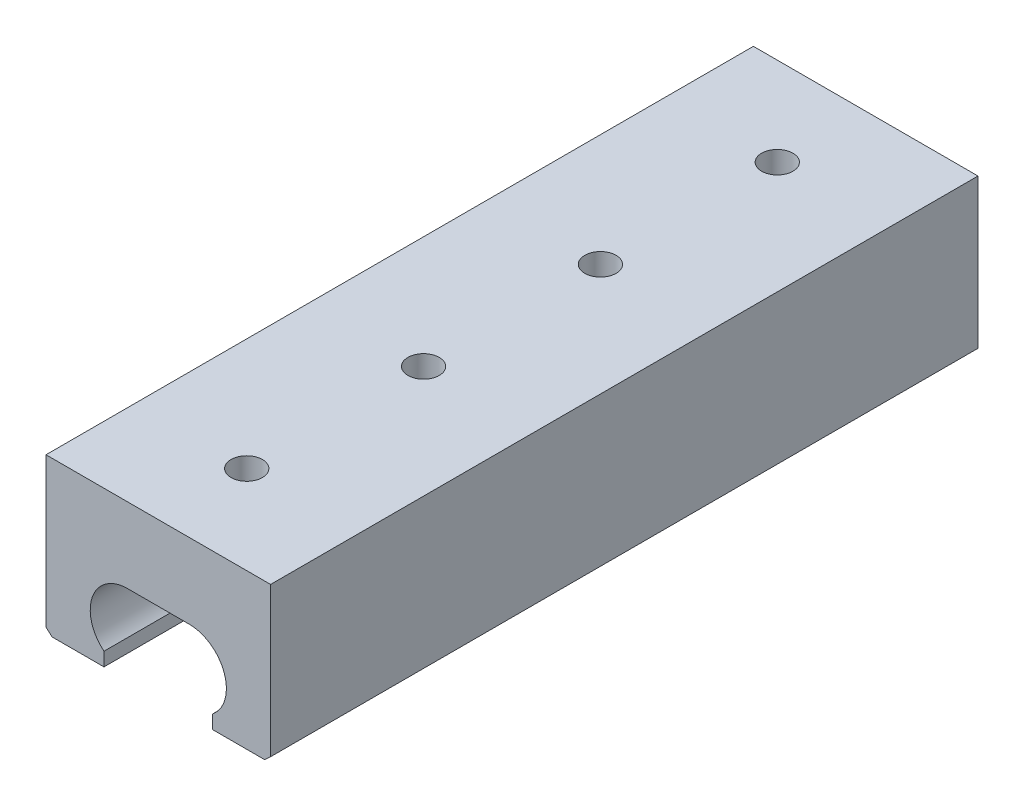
from build123d import *

# Parameters (mm, degrees)
BASE_EXTRUDE_DEPTH           = 203.2
TAP_DRILL_FOR_M10X1_0_TAP1_D = 9
LPATTERN2_COUNT              = 4
LPATTERN2_PITCH              = 50.8


with BuildPart() as part:
    # Sketch1 → Base-Extrude (new body)
    with BuildSketch(Plane.XY):
        with BuildLine():
            Line((-51.848409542, -29.029859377), (-51.848409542, -32.936966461))
            Line((-51.848409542, -32.936966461), (-66.799126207, -32.936966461))
            Line((-66.799126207, -32.936966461), (-68.5063829, -31.355514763))
            Line((-68.5063829, -31.355514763), (-68.5063829, 11.513033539))
            Line((-68.5063829, 11.513033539), (-3.9903829, 11.513033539))
            Line((-3.9903829, 11.513033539), (-3.9903829, -31.355514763))
            Line((-3.9903829, -31.355514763), (-5.697639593, -32.936966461))
            Line((-5.697639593, -32.936966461), (-20.648356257, -32.936966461))
            Line((-20.648356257, -32.936966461), (-20.648356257, -29.029859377))
            ThreePointArc((-20.648356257, -29.029859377), (-17.301518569, -17.177491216), (-27.3583829, -10.068382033))
            Line((-27.3583829, -10.068382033), (-45.1383829, -10.068382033))
            ThreePointArc((-45.1383829, -10.068382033), (-55.19524723, -17.177491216), (-51.848409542, -29.029859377))
        make_face()
    extrude(amount=BASE_EXTRUDE_DEPTH)

    # Tap Drill for M10x1.0 Tap1 (through all)
    with Locations(Plane(origin=(0, 11.513033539, 0), x_dir=(-1, 0, 0), z_dir=(0, 1, 0))):
        with Locations((36.2483829, 177.8)):
            tap_drill_for_m10x1_0_tap1 = Hole(TAP_DRILL_FOR_M10X1_0_TAP1_D / 2)

    # LPattern2: Tap Drill for M10x1.0 Tap1 ×4
    with Locations(*[(0, 0, -i * LPATTERN2_PITCH) for i in range(1, LPATTERN2_COUNT)]):
        add(tap_drill_for_m10x1_0_tap1, mode=Mode.SUBTRACT)


solid = part.part
